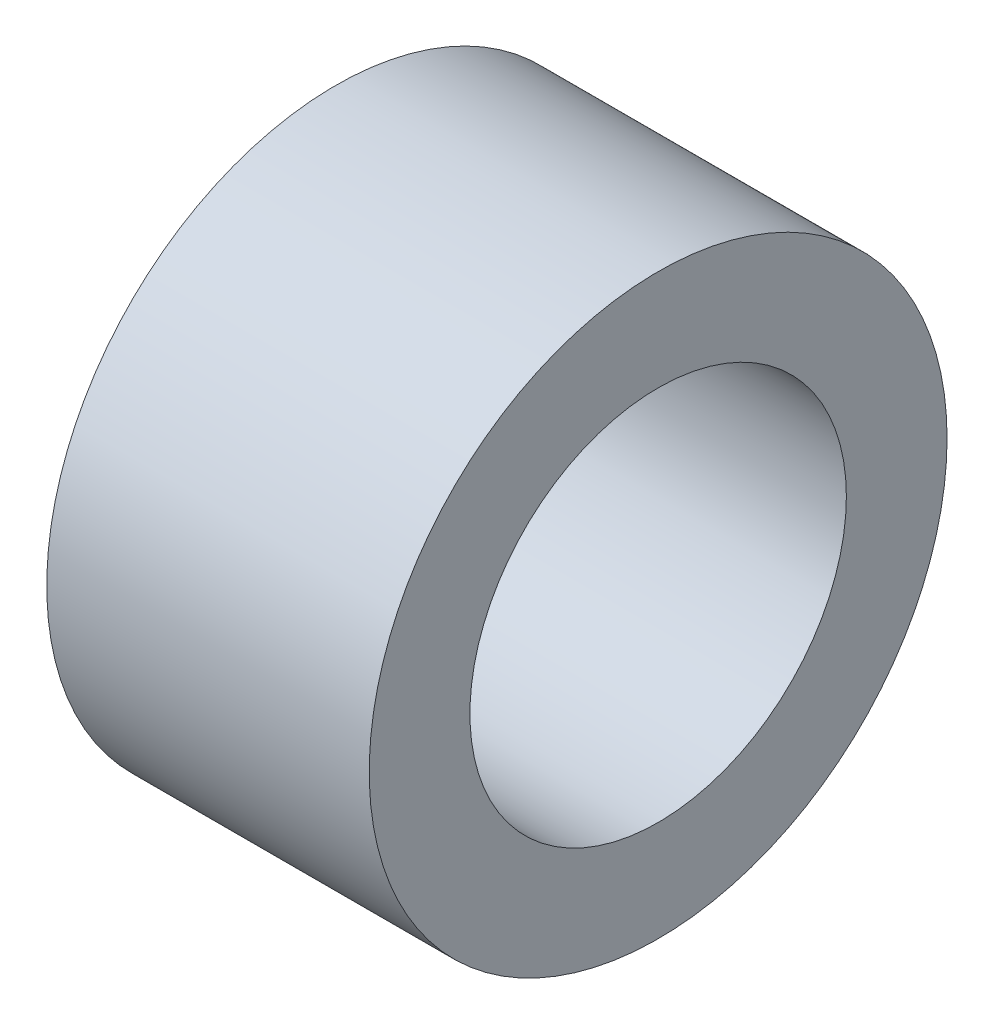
from build123d import *

# Parameters (mm, degrees)
SKETCH1_W = 12.5
SKETCH1_H = 3.903380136


with BuildPart() as part:
    # Sketch1 → Revolve1 (revolve)
    with BuildSketch(Plane.XY, mode=Mode.PRIVATE) as revolve1_sk:
        with Locations((-9.75, 9.248309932)):
            Rectangle(SKETCH1_W, SKETCH1_H)
    revolve(revolve1_sk.sketch.rotate(Axis((0, 0, 0), (-1, 0, 0)), 90), axis=Axis((0, 0, 0), (-1, 0, 0)))


solid = part.part
